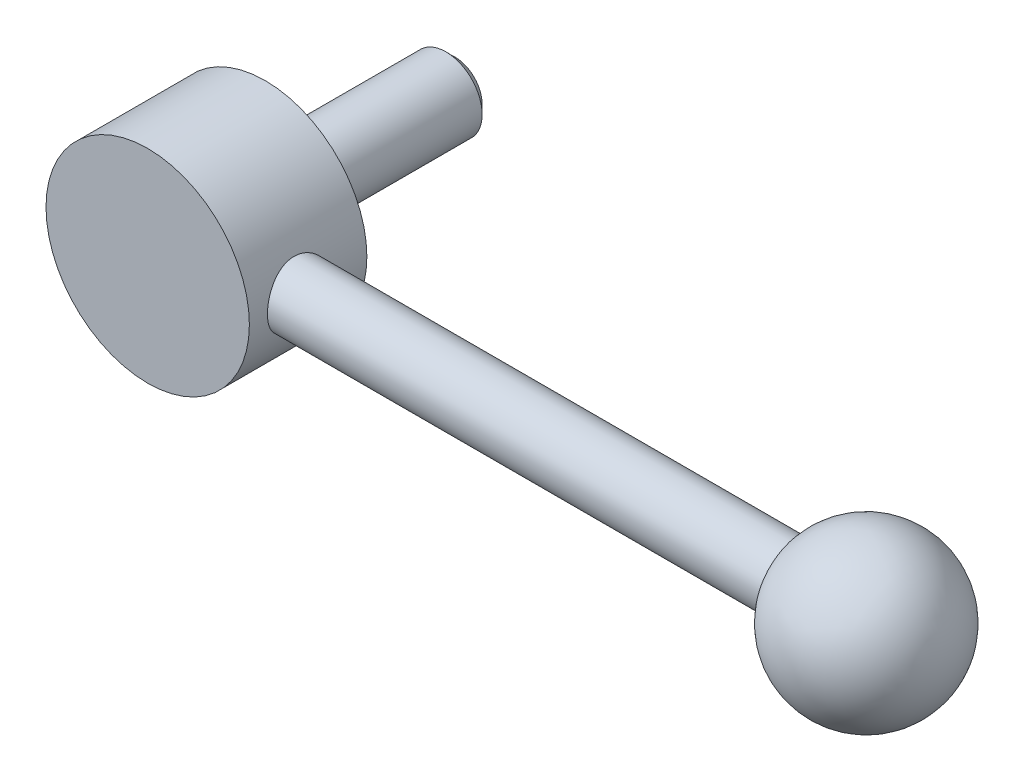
ISO-10303-21;
HEADER;
FILE_DESCRIPTION(('STEP AP214'),'2;1');
FILE_NAME('part.step','',(''),(''),'','','');
FILE_SCHEMA(('AUTOMOTIVE_DESIGN { 1 0 10303 214 1 1 1 1 }'));
ENDSEC;
DATA;
#1=APPLICATION_CONTEXT('core data for automotive mechanical design processes');
#2=APPLICATION_PROTOCOL_DEFINITION('international standard','automotive_design',2000,#1);
#3=PRODUCT_CONTEXT('',#1,'mechanical');
#4=PRODUCT('Part','Part','',(#3));
#5=PRODUCT_RELATED_PRODUCT_CATEGORY('part','',(#4));
#6=PRODUCT_DEFINITION_FORMATION('','',#4);
#7=PRODUCT_DEFINITION_CONTEXT('part definition',#1,'design');
#8=PRODUCT_DEFINITION('design','',#6,#7);
#9=PRODUCT_DEFINITION_SHAPE('','',#8);
#10=(LENGTH_UNIT() NAMED_UNIT(*) SI_UNIT(.MILLI.,.METRE.));
#11=(NAMED_UNIT(*) PLANE_ANGLE_UNIT() SI_UNIT($,.RADIAN.));
#12=(NAMED_UNIT(*) SI_UNIT($,.STERADIAN.) SOLID_ANGLE_UNIT());
#13=UNCERTAINTY_MEASURE_WITH_UNIT(LENGTH_MEASURE(1.E-05),#10,'distance_accuracy_value','');
#14=(GEOMETRIC_REPRESENTATION_CONTEXT(3) GLOBAL_UNCERTAINTY_ASSIGNED_CONTEXT((#13)) GLOBAL_UNIT_ASSIGNED_CONTEXT((#10,
#11,#12)) REPRESENTATION_CONTEXT('',''));
#15=CARTESIAN_POINT('',(0.,0.,0.));
#16=DIRECTION('',(0.,0.,1.));
#17=DIRECTION('',(1.,0.,0.));
#18=AXIS2_PLACEMENT_3D('',#15,#16,#17);
#19=CARTESIAN_POINT('',(0.,0.,40.));
#20=DIRECTION('',(0.,0.,1.));
#21=DIRECTION('',(1.,0.,0.));
#22=AXIS2_PLACEMENT_3D('',#19,#20,#21);
#23=CYLINDRICAL_SURFACE('',#22,11.5);
#24=CARTESIAN_POINT('',(0.,0.,2.));
#25=DIRECTION('',(0.,0.,1.));
#26=DIRECTION('',(1.,0.,0.));
#27=AXIS2_PLACEMENT_3D('',#24,#25,#26);
#28=CIRCLE('',#27,11.5);
#29=CARTESIAN_POINT('',(11.5,0.,2.));
#30=VERTEX_POINT('',#29);
#31=EDGE_CURVE('E37',#30,#30,#28,.T.);
#32=ORIENTED_EDGE('',*,*,#31,.F.);
#33=EDGE_LOOP('',(#32));
#34=FACE_BOUND('',#33,.T.);
#35=CARTESIAN_POINT('',(0.,0.,0.));
#36=DIRECTION('',(0.,0.,1.));
#37=DIRECTION('',(1.,0.,0.));
#38=AXIS2_PLACEMENT_3D('',#35,#36,#37);
#39=CIRCLE('',#38,11.5);
#40=CARTESIAN_POINT('',(11.5,0.,0.));
#41=VERTEX_POINT('',#40);
#42=EDGE_CURVE('E23',#41,#41,#39,.T.);
#43=ORIENTED_EDGE('',*,*,#42,.T.);
#44=EDGE_LOOP('',(#43));
#45=FACE_BOUND('',#44,.T.);
#46=ADVANCED_FACE('F12',(#34,#45),#23,.T.);
#47=CARTESIAN_POINT('',(8.,0.,0.));
#48=DIRECTION('',(0.,0.,1.));
#49=DIRECTION('',(1.,0.,0.));
#50=AXIS2_PLACEMENT_3D('',#47,#48,#49);
#51=PLANE('',#50);
#52=ORIENTED_EDGE('',*,*,#42,.F.);
#53=EDGE_LOOP('',(#52));
#54=FACE_BOUND('',#53,.T.);
#55=CARTESIAN_POINT('',(0.,0.,0.));
#56=DIRECTION('',(0.,0.,1.));
#57=DIRECTION('',(1.,0.,0.));
#58=AXIS2_PLACEMENT_3D('',#55,#56,#57);
#59=CIRCLE('',#58,8.);
#60=CARTESIAN_POINT('',(8.,0.,0.));
#61=VERTEX_POINT('',#60);
#62=EDGE_CURVE('E27',#61,#61,#59,.T.);
#63=ORIENTED_EDGE('',*,*,#62,.T.);
#64=EDGE_LOOP('',(#63));
#65=FACE_BOUND('',#64,.T.);
#66=ADVANCED_FACE('F63',(#54,#65),#51,.F.);
#67=CARTESIAN_POINT('',(0.,0.,40.));
#68=DIRECTION('',(0.,0.,1.));
#69=DIRECTION('',(1.,0.,0.));
#70=AXIS2_PLACEMENT_3D('',#67,#68,#69);
#71=CYLINDRICAL_SURFACE('',#70,8.);
#72=CARTESIAN_POINT('',(0.,0.,-38.));
#73=DIRECTION('',(0.,0.,-1.));
#74=DIRECTION('',(-1.,0.,0.));
#75=AXIS2_PLACEMENT_3D('',#72,#73,#74);
#76=CIRCLE('',#75,8.);
#77=CARTESIAN_POINT('',(-8.,0.,-38.));
#78=VERTEX_POINT('',#77);
#79=EDGE_CURVE('E19',#78,#78,#76,.F.);
#80=ORIENTED_EDGE('',*,*,#79,.T.);
#81=EDGE_LOOP('',(#80));
#82=FACE_BOUND('',#81,.T.);
#83=ORIENTED_EDGE('',*,*,#62,.F.);
#84=EDGE_LOOP('',(#83));
#85=FACE_BOUND('',#84,.T.);
#86=ADVANCED_FACE('F69',(#82,#85),#71,.T.);
#87=CARTESIAN_POINT('',(8.,0.,-40.));
#88=DIRECTION('',(0.,0.,-1.));
#89=DIRECTION('',(-1.,0.,0.));
#90=AXIS2_PLACEMENT_3D('',#87,#88,#89);
#91=PLANE('',#90);
#92=CARTESIAN_POINT('',(0.,0.,-40.));
#93=DIRECTION('',(0.,0.,-1.));
#94=DIRECTION('',(-1.,0.,0.));
#95=AXIS2_PLACEMENT_3D('',#92,#93,#94);
#96=CIRCLE('',#95,6.);
#97=CARTESIAN_POINT('',(-6.,0.,-40.));
#98=VERTEX_POINT('',#97);
#99=EDGE_CURVE('E8',#98,#98,#96,.T.);
#100=ORIENTED_EDGE('',*,*,#99,.T.);
#101=EDGE_LOOP('',(#100));
#102=FACE_BOUND('',#101,.T.);
#103=ADVANCED_FACE('F77',(#102),#91,.T.);
#104=CARTESIAN_POINT('',(22.5,0.,28.));
#105=DIRECTION('',(0.,0.,-1.));
#106=DIRECTION('',(-1.,0.,0.));
#107=AXIS2_PLACEMENT_3D('',#104,#105,#106);
#108=PLANE('',#107);
#109=CARTESIAN_POINT('',(0.,0.,28.));
#110=DIRECTION('',(0.,0.,1.));
#111=DIRECTION('',(1.,0.,0.));
#112=AXIS2_PLACEMENT_3D('',#109,#110,#111);
#113=CIRCLE('',#112,22.5);
#114=CARTESIAN_POINT('',(22.5,0.,28.));
#115=VERTEX_POINT('',#114);
#116=EDGE_CURVE('E86',#115,#115,#113,.T.);
#117=ORIENTED_EDGE('',*,*,#116,.T.);
#118=EDGE_LOOP('',(#117));
#119=FACE_BOUND('',#118,.T.);
#120=ADVANCED_FACE('F58',(#119),#108,.F.);
#121=CARTESIAN_POINT('',(0.,0.,40.));
#122=DIRECTION('',(0.,0.,1.));
#123=DIRECTION('',(1.,0.,0.));
#124=AXIS2_PLACEMENT_3D('',#121,#122,#123);
#125=CYLINDRICAL_SURFACE('',#124,22.5);
#126=CARTESIAN_POINT('',(22.5,0.,10.));
#127=CARTESIAN_POINT('',(22.4999998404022,-0.191677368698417,10.0000002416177));
#128=CARTESIAN_POINT('',(22.4975448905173,-0.383358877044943,10.0078793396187));
#129=CARTESIAN_POINT('',(22.4877923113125,-0.765308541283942,10.0393229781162));
#130=CARTESIAN_POINT('',(22.4804945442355,-0.955576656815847,10.0628879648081));
#131=CARTESIAN_POINT('',(22.4612564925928,-1.33331254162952,10.1254869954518));
#132=CARTESIAN_POINT('',(22.4493161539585,-1.52078027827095,10.1645212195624));
#133=CARTESIAN_POINT('',(22.4211118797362,-1.89165112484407,10.2577281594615));
#134=CARTESIAN_POINT('',(22.4048463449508,-2.07505270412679,10.3119064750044));
#135=CARTESIAN_POINT('',(22.3684646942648,-2.43611329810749,10.4348153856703));
#136=CARTESIAN_POINT('',(22.3483561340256,-2.61378279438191,10.503517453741));
#137=CARTESIAN_POINT('',(22.3047888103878,-2.96265393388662,10.6550124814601));
#138=CARTESIAN_POINT('',(22.281328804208,-3.13385314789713,10.7378106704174));
#139=CARTESIAN_POINT('',(22.2316747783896,-3.46860942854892,10.9168465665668));
#140=CARTESIAN_POINT('',(22.2054814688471,-3.63216846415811,11.0130807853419));
#141=CARTESIAN_POINT('',(22.1510251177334,-3.95072830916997,11.2183306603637));
#142=CARTESIAN_POINT('',(22.1227612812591,-4.10572579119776,11.327351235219));
#143=CARTESIAN_POINT('',(22.0343532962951,-4.56462383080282,11.6788046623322));
#144=CARTESIAN_POINT('',(21.9719820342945,-4.85343322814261,11.9408249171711));
#145=CARTESIAN_POINT('',(21.8481078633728,-5.38374028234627,12.5092913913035));
#146=CARTESIAN_POINT('',(21.7866051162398,-5.62522922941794,12.8157457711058));
#147=CARTESIAN_POINT('',(21.6993823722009,-5.94977072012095,13.3067462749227));
#148=CARTESIAN_POINT('',(21.670827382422,-6.05269326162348,13.4779461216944));
#149=CARTESIAN_POINT('',(21.6165738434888,-6.24368405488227,13.8288405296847));
#150=CARTESIAN_POINT('',(21.5908741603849,-6.33175821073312,14.0085316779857));
#151=CARTESIAN_POINT('',(21.5431267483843,-6.49235835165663,14.3752387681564));
#152=CARTESIAN_POINT('',(21.5210797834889,-6.56488108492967,14.5622562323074));
#153=CARTESIAN_POINT('',(21.4813641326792,-6.69369414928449,14.9421700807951));
#154=CARTESIAN_POINT('',(21.4636935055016,-6.74999167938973,15.1350638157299));
#155=CARTESIAN_POINT('',(21.4337574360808,-6.84444485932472,15.5195916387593));
#156=CARTESIAN_POINT('',(21.4213480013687,-6.88308642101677,15.7110952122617));
#157=CARTESIAN_POINT('',(21.4016029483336,-6.94423696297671,16.0968445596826));
#158=CARTESIAN_POINT('',(21.3942652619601,-6.96675251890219,16.2910891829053));
#159=CARTESIAN_POINT('',(21.3848978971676,-6.99545358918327,16.6809027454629));
#160=CARTESIAN_POINT('',(21.382868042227,-7.00163964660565,16.8764716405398));
#161=CARTESIAN_POINT('',(21.3841835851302,-6.99762087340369,17.2674203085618));
#162=CARTESIAN_POINT('',(21.387528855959,-6.98741643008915,17.4628000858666));
#163=CARTESIAN_POINT('',(21.3992467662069,-6.95144410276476,17.8441910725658));
#164=CARTESIAN_POINT('',(21.4074162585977,-6.92630487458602,18.0302682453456));
#165=CARTESIAN_POINT('',(21.4283669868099,-6.86121389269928,18.3996136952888));
#166=CARTESIAN_POINT('',(21.4411497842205,-6.82125712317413,18.5828809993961));
#167=CARTESIAN_POINT('',(21.4709424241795,-6.7268919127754,18.9452428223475));
#168=CARTESIAN_POINT('',(21.4879510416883,-6.67248765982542,19.1243385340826));
#169=CARTESIAN_POINT('',(21.5257120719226,-6.54964475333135,19.4773149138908));
#170=CARTESIAN_POINT('',(21.5464659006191,-6.48120079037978,19.6511935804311));
#171=CARTESIAN_POINT('',(21.5914465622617,-6.32975192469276,19.9949996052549));
#172=CARTESIAN_POINT('',(21.6157183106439,-6.24655500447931,20.1648364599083));
#173=CARTESIAN_POINT('',(21.6668400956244,-6.06685791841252,20.4969847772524));
#174=CARTESIAN_POINT('',(21.6936910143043,-5.97035319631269,20.6592936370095));
#175=CARTESIAN_POINT('',(21.749239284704,-5.76471421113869,20.9753768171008));
#176=CARTESIAN_POINT('',(21.777936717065,-5.65557939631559,21.1291507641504));
#177=CARTESIAN_POINT('',(21.836423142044,-5.42537787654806,21.4272728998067));
#178=CARTESIAN_POINT('',(21.866212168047,-5.30431080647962,21.5716207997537));
#179=CARTESIAN_POINT('',(21.9274745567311,-5.0452320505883,21.8563713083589));
#180=CARTESIAN_POINT('',(21.958963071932,-4.90670110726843,21.9962986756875));
#181=CARTESIAN_POINT('',(22.0214157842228,-4.61833304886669,22.2639997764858));
#182=CARTESIAN_POINT('',(22.0523801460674,-4.46849957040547,22.3917773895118));
#183=CARTESIAN_POINT('',(22.1129608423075,-4.15835706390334,22.6344343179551));
#184=CARTESIAN_POINT('',(22.142576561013,-3.99804333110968,22.749307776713));
#185=CARTESIAN_POINT('',(22.1996210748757,-3.66808403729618,22.9652340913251));
#186=CARTESIAN_POINT('',(22.2270507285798,-3.4984421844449,23.0662923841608));
#187=CARTESIAN_POINT('',(22.2791891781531,-3.14946058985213,23.2546406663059));
#188=CARTESIAN_POINT('',(22.3038740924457,-2.97005333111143,23.341812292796));
#189=CARTESIAN_POINT('',(22.3495532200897,-2.60412187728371,23.5006396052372));
#190=CARTESIAN_POINT('',(22.3705488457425,-2.41760043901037,23.5723012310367));
#191=CARTESIAN_POINT('',(22.4082535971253,-2.03872672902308,23.6995165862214));
#192=CARTESIAN_POINT('',(22.4249629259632,-1.84637473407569,23.7550710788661));
#193=CARTESIAN_POINT('',(22.4536048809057,-1.45728257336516,23.8495549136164));
#194=CARTESIAN_POINT('',(22.4655376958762,-1.26054258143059,23.8884849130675));
#195=CARTESIAN_POINT('',(22.4839130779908,-0.871811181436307,23.948173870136));
#196=CARTESIAN_POINT('',(22.4905485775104,-0.679926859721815,23.9695722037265));
#197=CARTESIAN_POINT('',(22.4988905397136,-0.294941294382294,23.9964448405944));
#198=CARTESIAN_POINT('',(22.5005971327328,-0.101840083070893,24.001919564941));
#199=CARTESIAN_POINT('',(22.4990337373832,0.284107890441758,23.9968939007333));
#200=CARTESIAN_POINT('',(22.4957643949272,0.476954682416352,23.9863955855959));
#201=CARTESIAN_POINT('',(22.4843416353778,0.860977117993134,23.9495270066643));
#202=CARTESIAN_POINT('',(22.4761882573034,1.0521527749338,23.9231568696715));
#203=CARTESIAN_POINT('',(22.4554847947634,1.42671362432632,23.8556400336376));
#204=CARTESIAN_POINT('',(22.4430488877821,1.61017439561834,23.8148764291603));
#205=CARTESIAN_POINT('',(22.4140684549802,1.97298394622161,23.7188213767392));
#206=CARTESIAN_POINT('',(22.3975225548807,2.15233132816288,23.6635250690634));
#207=CARTESIAN_POINT('',(22.3607552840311,2.50562583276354,23.5388775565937));
#208=CARTESIAN_POINT('',(22.3405349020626,2.67957439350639,23.4695301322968));
#209=CARTESIAN_POINT('',(22.2969201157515,3.02109307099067,23.3172751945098));
#210=CARTESIAN_POINT('',(22.2735245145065,3.18866075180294,23.2343625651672));
#211=CARTESIAN_POINT('',(22.2235592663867,3.5202550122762,23.0534553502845));
#212=CARTESIAN_POINT('',(22.196927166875,3.68410148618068,22.9551479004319));
#213=CARTESIAN_POINT('',(22.1416334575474,4.00303333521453,22.7456195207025));
#214=CARTESIAN_POINT('',(22.1129711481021,4.15811565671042,22.6343941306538));
#215=CARTESIAN_POINT('',(22.0543595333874,4.45854845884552,22.3997845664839));
#216=CARTESIAN_POINT('',(22.0244101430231,4.60389829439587,22.2763995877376));
#217=CARTESIAN_POINT('',(21.9639950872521,4.88399953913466,22.0182492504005));
#218=CARTESIAN_POINT('',(21.9335294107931,5.01875072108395,21.8834836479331));
#219=CARTESIAN_POINT('',(21.8716714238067,5.28194864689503,21.5978479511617));
#220=CARTESIAN_POINT('',(21.8402900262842,5.40993633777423,21.446552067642));
#221=CARTESIAN_POINT('',(21.778722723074,5.65269114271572,21.133557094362));
#222=CARTESIAN_POINT('',(21.7485364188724,5.7674626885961,20.9718615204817));
#223=CARTESIAN_POINT('',(21.6902133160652,5.98307012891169,20.6389845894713));
#224=CARTESIAN_POINT('',(21.6620773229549,6.08390056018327,20.4677995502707));
#225=CARTESIAN_POINT('',(21.6087222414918,6.27077082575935,20.1171905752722));
#226=CARTESIAN_POINT('',(21.5835019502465,6.35681676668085,19.9377700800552));
#227=CARTESIAN_POINT('',(21.5368298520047,6.51318654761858,19.5724944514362));
#228=CARTESIAN_POINT('',(21.5153649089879,6.58356543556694,19.3866645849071));
#229=CARTESIAN_POINT('',(21.4767854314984,6.70834974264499,19.0093553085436));
#230=CARTESIAN_POINT('',(21.4596691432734,6.76276160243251,18.8178782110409));
#231=CARTESIAN_POINT('',(21.4303403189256,6.85513428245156,18.4306463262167));
#232=CARTESIAN_POINT('',(21.4181272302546,6.89309695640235,18.2348920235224));
#233=CARTESIAN_POINT('',(21.3990152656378,6.95220219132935,17.8406058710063));
#234=CARTESIAN_POINT('',(21.3921161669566,6.97334545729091,17.6420741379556));
#235=CARTESIAN_POINT('',(21.3840536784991,6.99802863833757,17.2527924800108));
#236=CARTESIAN_POINT('',(21.3826459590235,7.00231848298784,17.0620947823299));
#237=CARTESIAN_POINT('',(21.3849355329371,6.99532322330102,16.6809486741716));
#238=CARTESIAN_POINT('',(21.3886345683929,6.98403280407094,16.4905003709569));
#239=CARTESIAN_POINT('',(21.4010215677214,6.94598254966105,16.1114036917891));
#240=CARTESIAN_POINT('',(21.4097074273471,6.91922923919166,15.9227545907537));
#241=CARTESIAN_POINT('',(21.4317998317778,6.8504931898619,15.5484622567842));
#242=CARTESIAN_POINT('',(21.445208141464,6.80850475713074,15.3628201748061));
#243=CARTESIAN_POINT('',(21.4761044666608,6.7104051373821,14.9986247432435));
#244=CARTESIAN_POINT('',(21.4935291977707,6.65451205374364,14.8200071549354));
#245=CARTESIAN_POINT('',(21.532065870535,6.52874130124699,14.4681109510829));
#246=CARTESIAN_POINT('',(21.553179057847,6.45885890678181,14.294834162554));
#247=CARTESIAN_POINT('',(21.598497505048,6.30565478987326,13.9547580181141));
#248=CARTESIAN_POINT('',(21.622702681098,6.22233343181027,13.7879584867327));
#249=CARTESIAN_POINT('',(21.6735512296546,6.04283665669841,13.4618116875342));
#250=CARTESIAN_POINT('',(21.7001947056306,5.94666069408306,13.3024647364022));
#251=CARTESIAN_POINT('',(21.7562945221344,5.73809693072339,12.9860832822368));
#252=CARTESIAN_POINT('',(21.7858200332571,5.62522322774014,12.8293812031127));
#253=CARTESIAN_POINT('',(21.8459271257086,5.38707171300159,12.5260042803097));
#254=CARTESIAN_POINT('',(21.876508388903,5.26179761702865,12.3793264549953));
#255=CARTESIAN_POINT('',(21.9379319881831,4.9995285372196,12.0967465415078));
#256=CARTESIAN_POINT('',(21.9687744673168,4.86252669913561,11.9608508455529));
#257=CARTESIAN_POINT('',(22.0298741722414,4.57775496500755,11.7008184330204));
#258=CARTESIAN_POINT('',(22.0601315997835,4.42998886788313,11.5766776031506));
#259=CARTESIAN_POINT('',(22.1202447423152,4.11953578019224,11.3370395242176));
#260=CARTESIAN_POINT('',(22.1500549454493,3.95651883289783,11.2219578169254));
#261=CARTESIAN_POINT('',(22.207366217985,3.62102613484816,11.0060070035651));
#262=CARTESIAN_POINT('',(22.2348681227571,3.44855384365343,10.9051327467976));
#263=CARTESIAN_POINT('',(22.286793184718,3.09527336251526,10.7183440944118));
#264=CARTESIAN_POINT('',(22.3112167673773,2.91446632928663,10.6324276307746));
#265=CARTESIAN_POINT('',(22.3562872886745,2.54576090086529,10.4762606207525));
#266=CARTESIAN_POINT('',(22.3769345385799,2.35786309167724,10.4060087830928));
#267=CARTESIAN_POINT('',(22.4122437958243,1.99297373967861,10.2872063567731));
#268=CARTESIAN_POINT('',(22.4272705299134,1.81645819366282,10.2372983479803));
#269=CARTESIAN_POINT('',(22.4533075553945,1.45977603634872,10.1514456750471));
#270=CARTESIAN_POINT('',(22.4643180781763,1.27960963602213,10.1155002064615));
#271=CARTESIAN_POINT('',(22.4820479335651,0.916792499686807,10.0578654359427));
#272=CARTESIAN_POINT('',(22.4887670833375,0.734141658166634,10.0361767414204));
#273=CARTESIAN_POINT('',(22.4977423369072,0.36766149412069,10.007246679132));
#274=CARTESIAN_POINT('',(22.500000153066,0.183832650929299,9.99999976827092));
#275=CARTESIAN_POINT('',(22.5,0.,10.));
#276=B_SPLINE_CURVE_WITH_KNOTS('',3,(#126,#127,#128,#129,#130,#131,#132,#133,#134,#135,#136,
#137,#138,#139,#140,#141,#142,#143,#144,#145,#146,#147,#148,#149,#150,#151,#152,#153,#154,#155,
#156,#157,#158,#159,#160,#161,#162,#163,#164,#165,#166,#167,#168,#169,#170,#171,#172,#173,#174,
#175,#176,#177,#178,#179,#180,#181,#182,#183,#184,#185,#186,#187,#188,#189,#190,#191,#192,#193,
#194,#195,#196,#197,#198,#199,#200,#201,#202,#203,#204,#205,#206,#207,#208,#209,#210,#211,#212,
#213,#214,#215,#216,#217,#218,#219,#220,#221,#222,#223,#224,#225,#226,#227,#228,#229,#230,#231,
#232,#233,#234,#235,#236,#237,#238,#239,#240,#241,#242,#243,#244,#245,#246,#247,#248,#249,#250,
#251,#252,#253,#254,#255,#256,#257,#258,#259,#260,#261,#262,#263,#264,#265,#266,#267,#268,#269,
#270,#271,#272,#273,#274,#275),.UNSPECIFIED.,.T.,.F.,(4,2,2,2,2,2,2,2,2,2,2,2,2,2,2,2,2,2,2,2,2,
2,2,2,2,2,2,2,2,2,2,2,2,2,2,2,2,2,2,2,2,2,2,2,2,2,2,2,2,2,2,2,2,2,2,2,2,2,2,2,2,2,2,2,2,2,2,2,2,
2,2,2,2,2,4),(0.,0.574862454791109,1.14974126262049,1.72462676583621,2.29972512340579,
2.87370421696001,3.44789670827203,4.02194039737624,4.59620563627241,5.77524816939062,
6.95450751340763,7.55923977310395,8.16373100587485,8.76834851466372,9.37269734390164,
9.95922932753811,10.5455220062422,11.1317951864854,11.7180545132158,12.2812290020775,
12.8445943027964,13.4077964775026,13.9712120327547,14.5425858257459,15.1141557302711,
15.6857506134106,16.2573629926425,16.85487964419,17.4522048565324,18.0498000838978,
18.6471594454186,19.2493655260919,19.8513405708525,20.4532870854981,21.0552097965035,
21.6340578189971,22.2128905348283,22.7916481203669,23.3704010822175,23.9347859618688,
24.499359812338,25.0637819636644,25.6284174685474,26.2065358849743,26.7848545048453,
27.3632114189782,27.9415807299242,28.5427881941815,29.1437934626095,29.74503358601,
30.3460247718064,30.9448697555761,31.5434728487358,32.1420084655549,32.7405189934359,
33.3120739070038,33.8838238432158,34.4553327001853,35.0270553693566,35.5903206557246,
36.1537765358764,36.7172171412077,37.2806816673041,37.8661164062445,38.4513762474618,
39.0369805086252,39.6223790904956,40.2269255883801,40.8312523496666,41.4354954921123,
42.0396888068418,42.5912440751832,43.1427675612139,43.6943145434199,44.2456497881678),.UNSPECIFIED.);
#277=CARTESIAN_POINT('',(22.5,0.,10.));
#278=VERTEX_POINT('',#277);
#279=EDGE_CURVE('E30',#278,#278,#276,.T.);
#280=ORIENTED_EDGE('',*,*,#279,.T.);
#281=EDGE_LOOP('',(#280));
#282=FACE_BOUND('',#281,.T.);
#283=ORIENTED_EDGE('',*,*,#116,.F.);
#284=EDGE_LOOP('',(#283));
#285=FACE_BOUND('',#284,.T.);
#286=CARTESIAN_POINT('',(0.,0.,2.));
#287=DIRECTION('',(0.,0.,1.));
#288=DIRECTION('',(1.,0.,0.));
#289=AXIS2_PLACEMENT_3D('',#286,#287,#288);
#290=CIRCLE('',#289,22.5);
#291=CARTESIAN_POINT('',(22.5,0.,2.));
#292=VERTEX_POINT('',#291);
#293=EDGE_CURVE('E88',#292,#292,#290,.T.);
#294=ORIENTED_EDGE('',*,*,#293,.T.);
#295=EDGE_LOOP('',(#294));
#296=FACE_BOUND('',#295,.T.);
#297=ADVANCED_FACE('F40',(#282,#285,#296),#125,.T.);
#298=CARTESIAN_POINT('',(11.5,0.,2.));
#299=DIRECTION('',(0.,0.,1.));
#300=DIRECTION('',(1.,0.,0.));
#301=AXIS2_PLACEMENT_3D('',#298,#299,#300);
#302=PLANE('',#301);
#303=ORIENTED_EDGE('',*,*,#293,.F.);
#304=EDGE_LOOP('',(#303));
#305=FACE_BOUND('',#304,.T.);
#306=ORIENTED_EDGE('',*,*,#31,.T.);
#307=EDGE_LOOP('',(#306));
#308=FACE_BOUND('',#307,.T.);
#309=ADVANCED_FACE('F49',(#305,#308),#302,.F.);
#310=CARTESIAN_POINT('',(-30.,0.,17.));
#311=DIRECTION('',(-1.,0.,0.));
#312=DIRECTION('',(0.,0.,1.));
#313=AXIS2_PLACEMENT_3D('',#310,#311,#312);
#314=CYLINDRICAL_SURFACE('',#313,7.);
#315=CARTESIAN_POINT('',(131.960985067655,0.,17.));
#316=DIRECTION('',(-1.,0.,0.));
#317=DIRECTION('',(0.,0.,1.));
#318=AXIS2_PLACEMENT_3D('',#315,#316,#317);
#319=CIRCLE('',#318,7.);
#320=CARTESIAN_POINT('',(131.960985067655,0.,24.));
#321=VERTEX_POINT('',#320);
#322=EDGE_CURVE('E38',#321,#321,#319,.T.);
#323=ORIENTED_EDGE('',*,*,#322,.T.);
#324=EDGE_LOOP('',(#323));
#325=FACE_BOUND('',#324,.T.);
#326=ORIENTED_EDGE('',*,*,#279,.F.);
#327=EDGE_LOOP('',(#326));
#328=FACE_BOUND('',#327,.T.);
#329=ADVANCED_FACE('F44',(#325,#328),#314,.T.);
#330=CARTESIAN_POINT('',(148.,0.,17.));
#331=DIRECTION('',(0.,0.,1.));
#332=DIRECTION('',(1.,0.,0.));
#333=AXIS2_PLACEMENT_3D('',#330,#331,#332);
#334=SPHERICAL_SURFACE('',#333,17.5);
#335=CARTESIAN_POINT('',(148.,0.,17.));
#336=DIRECTION('',(-1.,0.,0.));
#337=DIRECTION('',(0.,0.,1.));
#338=AXIS2_PLACEMENT_3D('',#335,#336,#337);
#339=SPHERICAL_SURFACE('',#338,17.5);
#340=ORIENTED_EDGE('',*,*,#322,.F.);
#341=EDGE_LOOP('',(#340));
#342=FACE_BOUND('',#341,.T.);
#343=ADVANCED_FACE('F48',(#342),#339,.T.);
#344=CARTESIAN_POINT('',(0.,0.,-38.));
#345=DIRECTION('',(0.,0.,1.));
#346=DIRECTION('',(1.,0.,0.));
#347=AXIS2_PLACEMENT_3D('',#344,#345,#346);
#348=CONICAL_SURFACE('',#347,8.,0.785398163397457);
#349=ORIENTED_EDGE('',*,*,#99,.F.);
#350=EDGE_LOOP('',(#349));
#351=FACE_BOUND('',#350,.T.);
#352=ORIENTED_EDGE('',*,*,#79,.F.);
#353=EDGE_LOOP('',(#352));
#354=FACE_BOUND('',#353,.T.);
#355=ADVANCED_FACE('F14',(#351,#354),#348,.T.);
#356=CLOSED_SHELL('',(#46,#66,#86,#103,#120,#297,#309,#329,#343,#355));
#357=MANIFOLD_SOLID_BREP('B1',#356);
#358=ADVANCED_BREP_SHAPE_REPRESENTATION('',(#18,#357),#14);
#359=SHAPE_DEFINITION_REPRESENTATION(#9,#358);
ENDSEC;
END-ISO-10303-21;
